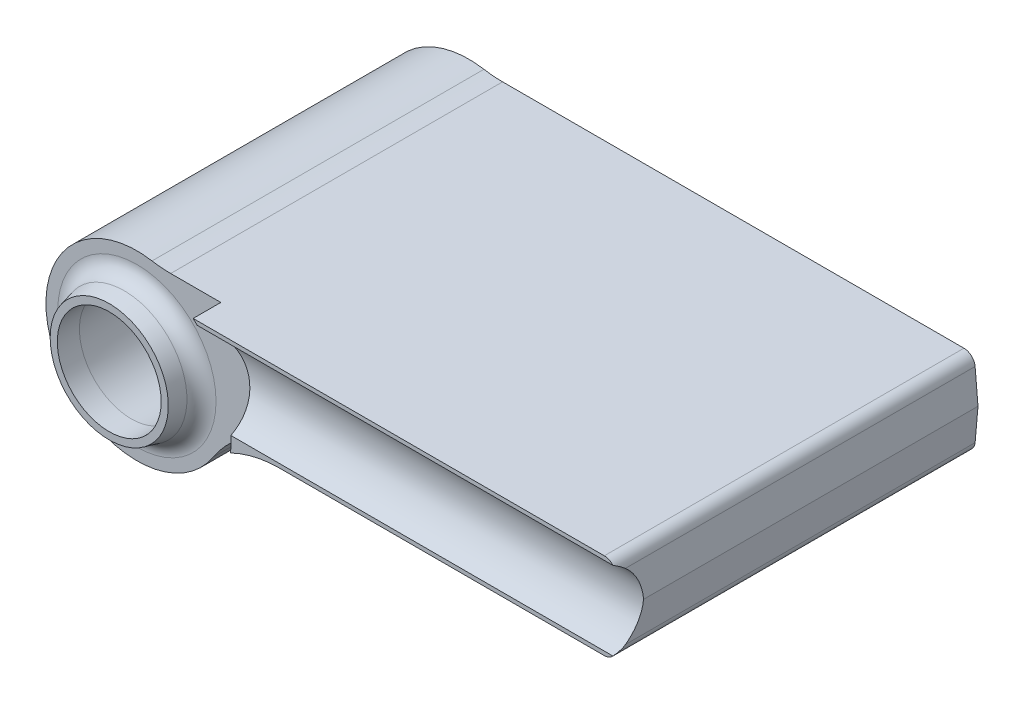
from build123d import *

# Parameters (mm, degrees)
BASE_EXTRUSION_DEPTH    = 65
ENL_V_MAT_EXTRU_1_REACH = 132.059
ESQUISSE4_R             = 7.815
ESQUISSE5_R             = 9.39
ENL_V_MAT_EXTRU_2_DEPTH = 4
ESQUISSE6_R             = 9.39
ENL_V_MAT_EXTRU_3_DEPTH = 112.631735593
ENL_V_MAT_EXTRU_3_DRAFT = 3
PER_AGE1_D              = 8.5
PER_AGE1_DEPTH          = 48
PER_AGE1_TIP            = 2.453738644
PER_AGE2_D              = 8.5
PER_AGE2_DEPTH          = 48
PER_AGE2_TIP            = 2.453738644


with BuildPart() as part:
    # Esquisse1 → Base-Extrusion (new body)
    with BuildSketch(Plane.XY):
        with BuildLine():
            Line((6.100803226, 15.935), (89.489847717, 15.935))
            ThreePointArc((89.489847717, 15.935), (90.861295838, 15.401672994), (91.512122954, 14.081926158))
            Line((91.512122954, 14.081926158), (92.033723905, 8.12))
            Line((92.033723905, 8.12), (91.512122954, 2.158073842))
            ThreePointArc((91.512122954, 2.158073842), (90.861295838, 0.838327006), (89.489847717, 0.305))
            Line((89.489847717, 0.305), (30.828477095, 0.305))
            ThreePointArc((30.828477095, 0.305), (21.137014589, -2.157804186), (13.797096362, -8.948639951))
            ThreePointArc((13.797096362, -8.948639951), (-15.053690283, -6.620002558), (2.730377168, 16.216752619))
            ThreePointArc((2.730377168, 16.216752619), (4.409712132, 16.005560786), (6.100803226, 15.935))
        make_face()
    extrude(amount=BASE_EXTRUSION_DEPTH)

    # Esquisse3 → Enl_vement de mati_re-R_volution2 (revolve, cut)
    with BuildSketch(Plane(origin=(0, 0, 0), x_dir=(1, 0, 0), z_dir=(0, 1, 0)), mode=Mode.PRIVATE) as enl_vement_de_mati_re_r_volution2_sk:
        with BuildLine():
            Line((10.68, -65), (11.352049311, -62.304557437))
            ThreePointArc((11.352049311, -62.304557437), (12.430137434, -60.644447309), (14.301748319, -60))
            Line((14.301748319, -60), (22, -60))
            Line((22, -60), (22, -65))
            Line((22, -65), (10.68, -65))
        make_face()
    revolve(enl_vement_de_mati_re_r_volution2_sk.sketch.rotate(Axis((0, 0, -7.823723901), (0, 0, 1)), 180), axis=Axis((0, 0, -7.823723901), (0, 0, 1)), mode=Mode.SUBTRACT)

    # Esquisse4 → Enl_v. mat.-Extru.1 (cut, up to next)
    with BuildSketch(Plane(origin=(95, 0, 0), x_dir=(0, 0, -1), z_dir=(1, 0, 0)), mode=Mode.PRIVATE) as enl_v_mat_extru_1_sk1:
        with Locations((-68.27, 8.12)):
            Circle(ESQUISSE4_R)
    enl_v_mat_extru_1_tool1 = extrude(enl_v_mat_extru_1_sk1.sketch, amount=-ENL_V_MAT_EXTRU_1_REACH, mode=Mode.PRIVATE) & part.part
    add(enl_v_mat_extru_1_tool1.solids().sort_by_distance((95, 8.12, 68.27))[0], mode=Mode.SUBTRACT)

    # Esquisse5 → Enl_v. mat.-Extru.2 (cut)
    with BuildSketch(Plane.XY.offset(65)):
        Circle(ESQUISSE5_R)
    extrude(amount=-ENL_V_MAT_EXTRU_2_DEPTH, mode=Mode.SUBTRACT)


with BuildPart() as enl_v_mat_extru_3_tool:
    # Esquisse6 → Enl_v. mat.-Extru.3 (with draft: the straight prism first)
    with BuildSketch(Plane.XY.offset(61)):
        Circle(ESQUISSE6_R)
    extrude(amount=-ENL_V_MAT_EXTRU_3_DEPTH)
    # Enl_v. mat.-Extru.3: the draft: its side faces are tilted about the plane it starts from
    enl_v_mat_extru_3_sides = [enl_v_mat_extru_3_tool.faces().sort_by_distance(p)[0] for p in [
        (-9.39, 0, 4.684132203),
    ]]
    draft(enl_v_mat_extru_3_sides, Plane.XY.offset(61), ENL_V_MAT_EXTRU_3_DRAFT)


with BuildPart() as part_1:
    add(part.part)

    # Enl_v. mat.-Extru.3: cut by enl_v_mat_extru_3_tool
    add(enl_v_mat_extru_3_tool.part, mode=Mode.SUBTRACT)

    # Per_age1
    with Locations(Plane(origin=(0, 0, 0), x_dir=(-1, 0, 0), z_dir=(0, 0, -1))):
        with Locations((-30, 8.12)):
            Hole(PER_AGE1_D / 2, depth=PER_AGE1_DEPTH)
            with Locations((0, 0, -(PER_AGE1_DEPTH + PER_AGE1_TIP / 2))):  # 120° drill point
                Cone(0, PER_AGE1_D / 2, PER_AGE1_TIP, mode=Mode.SUBTRACT)

    # Per_age2
    with Locations(Plane(origin=(0, 0, 0), x_dir=(-1, 0, 0), z_dir=(0, 0, -1))):
        with Locations((-75, 8.12)):
            Hole(PER_AGE2_D / 2, depth=PER_AGE2_DEPTH)
            with Locations((0, 0, -(PER_AGE2_DEPTH + PER_AGE2_TIP / 2))):  # 120° drill point
                Cone(0, PER_AGE2_D / 2, PER_AGE2_TIP, mode=Mode.SUBTRACT)


solid = part_1.part
